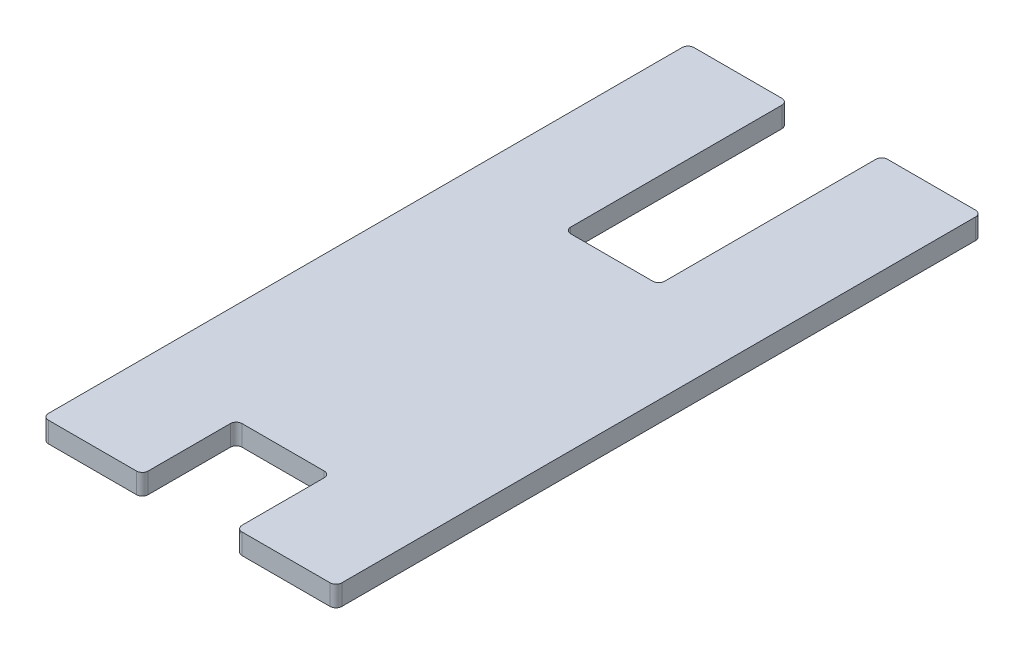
ISO-10303-21;
HEADER;
FILE_DESCRIPTION(('STEP AP214'),'2;1');
FILE_NAME('part.step','',(''),(''),'','','');
FILE_SCHEMA(('AUTOMOTIVE_DESIGN { 1 0 10303 214 1 1 1 1 }'));
ENDSEC;
DATA;
#1=APPLICATION_CONTEXT('core data for automotive mechanical design processes');
#2=APPLICATION_PROTOCOL_DEFINITION('international standard','automotive_design',2000,#1);
#3=PRODUCT_CONTEXT('',#1,'mechanical');
#4=PRODUCT('Part','Part','',(#3));
#5=PRODUCT_RELATED_PRODUCT_CATEGORY('part','',(#4));
#6=PRODUCT_DEFINITION_FORMATION('','',#4);
#7=PRODUCT_DEFINITION_CONTEXT('part definition',#1,'design');
#8=PRODUCT_DEFINITION('design','',#6,#7);
#9=PRODUCT_DEFINITION_SHAPE('','',#8);
#10=(LENGTH_UNIT() NAMED_UNIT(*) SI_UNIT(.MILLI.,.METRE.));
#11=(NAMED_UNIT(*) PLANE_ANGLE_UNIT() SI_UNIT($,.RADIAN.));
#12=(NAMED_UNIT(*) SI_UNIT($,.STERADIAN.) SOLID_ANGLE_UNIT());
#13=UNCERTAINTY_MEASURE_WITH_UNIT(LENGTH_MEASURE(1.E-05),#10,'distance_accuracy_value','');
#14=(GEOMETRIC_REPRESENTATION_CONTEXT(3) GLOBAL_UNCERTAINTY_ASSIGNED_CONTEXT((#13)) GLOBAL_UNIT_ASSIGNED_CONTEXT((#10,
#11,#12)) REPRESENTATION_CONTEXT('',''));
#15=CARTESIAN_POINT('',(0.,0.,0.));
#16=DIRECTION('',(0.,0.,1.));
#17=DIRECTION('',(1.,0.,0.));
#18=AXIS2_PLACEMENT_3D('',#15,#16,#17);
#19=CARTESIAN_POINT('',(-25.,3.5,-110.));
#20=DIRECTION('',(1.,0.,0.));
#21=DIRECTION('',(0.,0.,-1.));
#22=AXIS2_PLACEMENT_3D('',#19,#20,#21);
#23=PLANE('',#22);
#24=DIRECTION('',(0.,0.,1.));
#25=VECTOR('',#24,1.);
#26=CARTESIAN_POINT('',(-25.,3.5,-110.));
#27=LINE('',#26,#25);
#28=CARTESIAN_POINT('',(-25.,3.5,-109.));
#29=VERTEX_POINT('',#28);
#30=CARTESIAN_POINT('',(-25.,3.5,-1.));
#31=VERTEX_POINT('',#30);
#32=EDGE_CURVE('E213',#29,#31,#27,.T.);
#33=ORIENTED_EDGE('',*,*,#32,.F.);
#34=DIRECTION('',(0.,-1.,0.));
#35=VECTOR('',#34,1.);
#36=CARTESIAN_POINT('',(-25.,3.5,-109.));
#37=LINE('',#36,#35);
#38=CARTESIAN_POINT('',(-25.,0.,-109.));
#39=VERTEX_POINT('',#38);
#40=EDGE_CURVE('E198',#29,#39,#37,.T.);
#41=ORIENTED_EDGE('',*,*,#40,.T.);
#42=DIRECTION('',(0.,0.,1.));
#43=VECTOR('',#42,1.);
#44=CARTESIAN_POINT('',(-25.,0.,-110.));
#45=LINE('',#44,#43);
#46=CARTESIAN_POINT('',(-25.,0.,-1.));
#47=VERTEX_POINT('',#46);
#48=EDGE_CURVE('E210',#39,#47,#45,.T.);
#49=ORIENTED_EDGE('',*,*,#48,.T.);
#50=DIRECTION('',(0.,-1.,0.));
#51=VECTOR('',#50,1.);
#52=CARTESIAN_POINT('',(-25.,3.5,-1.));
#53=LINE('',#52,#51);
#54=EDGE_CURVE('E215',#47,#31,#53,.F.);
#55=ORIENTED_EDGE('',*,*,#54,.T.);
#56=EDGE_LOOP('',(#33,#41,#49,#55));
#57=FACE_BOUND('',#56,.T.);
#58=ADVANCED_FACE('F32',(#57),#23,.F.);
#59=CARTESIAN_POINT('',(-25.,3.5,0.));
#60=DIRECTION('',(0.,0.,-1.));
#61=DIRECTION('',(-1.,0.,0.));
#62=AXIS2_PLACEMENT_3D('',#59,#60,#61);
#63=PLANE('',#62);
#64=DIRECTION('',(1.,0.,0.));
#65=VECTOR('',#64,1.);
#66=CARTESIAN_POINT('',(-25.,0.,0.));
#67=LINE('',#66,#65);
#68=CARTESIAN_POINT('',(-24.,0.,0.));
#69=VERTEX_POINT('',#68);
#70=CARTESIAN_POINT('',(-9.,0.,0.));
#71=VERTEX_POINT('',#70);
#72=EDGE_CURVE('E220',#69,#71,#67,.T.);
#73=ORIENTED_EDGE('',*,*,#72,.T.);
#74=DIRECTION('',(0.,-1.,0.));
#75=VECTOR('',#74,1.);
#76=CARTESIAN_POINT('',(-9.,3.5,0.));
#77=LINE('',#76,#75);
#78=CARTESIAN_POINT('',(-9.,3.5,0.));
#79=VERTEX_POINT('',#78);
#80=EDGE_CURVE('E334',#71,#79,#77,.F.);
#81=ORIENTED_EDGE('',*,*,#80,.T.);
#82=DIRECTION('',(1.,0.,0.));
#83=VECTOR('',#82,1.);
#84=CARTESIAN_POINT('',(-25.,3.5,0.));
#85=LINE('',#84,#83);
#86=CARTESIAN_POINT('',(-24.,3.5,0.));
#87=VERTEX_POINT('',#86);
#88=EDGE_CURVE('E373',#87,#79,#85,.T.);
#89=ORIENTED_EDGE('',*,*,#88,.F.);
#90=DIRECTION('',(0.,-1.,0.));
#91=VECTOR('',#90,1.);
#92=CARTESIAN_POINT('',(-24.,3.5,0.));
#93=LINE('',#92,#91);
#94=EDGE_CURVE('E331',#87,#69,#93,.T.);
#95=ORIENTED_EDGE('',*,*,#94,.T.);
#96=EDGE_LOOP('',(#73,#81,#89,#95));
#97=FACE_BOUND('',#96,.T.);
#98=ADVANCED_FACE('F464',(#97),#63,.F.);
#99=CARTESIAN_POINT('',(-8.,3.5,-16.));
#100=DIRECTION('',(-1.,0.,0.));
#101=DIRECTION('',(0.,0.,1.));
#102=AXIS2_PLACEMENT_3D('',#99,#100,#101);
#103=PLANE('',#102);
#104=DIRECTION('',(0.,0.,-1.));
#105=VECTOR('',#104,1.);
#106=CARTESIAN_POINT('',(-8.,0.,-16.));
#107=LINE('',#106,#105);
#108=CARTESIAN_POINT('',(-8.,0.,-1.));
#109=VERTEX_POINT('',#108);
#110=CARTESIAN_POINT('',(-8.,0.,-15.));
#111=VERTEX_POINT('',#110);
#112=EDGE_CURVE('E223',#109,#111,#107,.T.);
#113=ORIENTED_EDGE('',*,*,#112,.T.);
#114=DIRECTION('',(0.,-1.,0.));
#115=VECTOR('',#114,1.);
#116=CARTESIAN_POINT('',(-8.,3.5,-15.));
#117=LINE('',#116,#115);
#118=CARTESIAN_POINT('',(-8.,3.5,-15.));
#119=VERTEX_POINT('',#118);
#120=EDGE_CURVE('E329',#111,#119,#117,.F.);
#121=ORIENTED_EDGE('',*,*,#120,.T.);
#122=DIRECTION('',(0.,0.,-1.));
#123=VECTOR('',#122,1.);
#124=CARTESIAN_POINT('',(-8.,3.5,-16.));
#125=LINE('',#124,#123);
#126=CARTESIAN_POINT('',(-8.,3.5,-1.));
#127=VERTEX_POINT('',#126);
#128=EDGE_CURVE('E364',#127,#119,#125,.T.);
#129=ORIENTED_EDGE('',*,*,#128,.F.);
#130=DIRECTION('',(0.,-1.,0.));
#131=VECTOR('',#130,1.);
#132=CARTESIAN_POINT('',(-8.,3.5,-1.));
#133=LINE('',#132,#131);
#134=EDGE_CURVE('E326',#127,#109,#133,.T.);
#135=ORIENTED_EDGE('',*,*,#134,.T.);
#136=EDGE_LOOP('',(#113,#121,#129,#135));
#137=FACE_BOUND('',#136,.T.);
#138=ADVANCED_FACE('F352',(#137),#103,.F.);
#139=CARTESIAN_POINT('',(-8.,3.5,-16.));
#140=DIRECTION('',(0.,0.,-1.));
#141=DIRECTION('',(-1.,0.,0.));
#142=AXIS2_PLACEMENT_3D('',#139,#140,#141);
#143=PLANE('',#142);
#144=DIRECTION('',(1.,0.,0.));
#145=VECTOR('',#144,1.);
#146=CARTESIAN_POINT('',(-8.,0.,-16.));
#147=LINE('',#146,#145);
#148=CARTESIAN_POINT('',(-7.,0.,-16.));
#149=VERTEX_POINT('',#148);
#150=CARTESIAN_POINT('',(7.,0.,-16.));
#151=VERTEX_POINT('',#150);
#152=EDGE_CURVE('E231',#149,#151,#147,.T.);
#153=ORIENTED_EDGE('',*,*,#152,.T.);
#154=DIRECTION('',(0.,-1.,0.));
#155=VECTOR('',#154,1.);
#156=CARTESIAN_POINT('',(7.,3.5,-16.));
#157=LINE('',#156,#155);
#158=CARTESIAN_POINT('',(7.,3.5,-16.));
#159=VERTEX_POINT('',#158);
#160=EDGE_CURVE('E324',#151,#159,#157,.F.);
#161=ORIENTED_EDGE('',*,*,#160,.T.);
#162=DIRECTION('',(1.,0.,0.));
#163=VECTOR('',#162,1.);
#164=CARTESIAN_POINT('',(-8.,3.5,-16.));
#165=LINE('',#164,#163);
#166=CARTESIAN_POINT('',(-7.,3.5,-16.));
#167=VERTEX_POINT('',#166);
#168=EDGE_CURVE('E362',#167,#159,#165,.T.);
#169=ORIENTED_EDGE('',*,*,#168,.F.);
#170=DIRECTION('',(0.,-1.,0.));
#171=VECTOR('',#170,1.);
#172=CARTESIAN_POINT('',(-7.,0.,-16.));
#173=LINE('',#172,#171);
#174=EDGE_CURVE('E321',#167,#149,#173,.T.);
#175=ORIENTED_EDGE('',*,*,#174,.T.);
#176=EDGE_LOOP('',(#153,#161,#169,#175));
#177=FACE_BOUND('',#176,.T.);
#178=ADVANCED_FACE('F366',(#177),#143,.F.);
#179=CARTESIAN_POINT('',(8.,3.5,-16.));
#180=DIRECTION('',(1.,0.,0.));
#181=DIRECTION('',(0.,0.,-1.));
#182=AXIS2_PLACEMENT_3D('',#179,#180,#181);
#183=PLANE('',#182);
#184=DIRECTION('',(0.,0.,1.));
#185=VECTOR('',#184,1.);
#186=CARTESIAN_POINT('',(8.,0.,-16.));
#187=LINE('',#186,#185);
#188=CARTESIAN_POINT('',(8.,0.,-15.));
#189=VERTEX_POINT('',#188);
#190=CARTESIAN_POINT('',(8.,0.,-1.));
#191=VERTEX_POINT('',#190);
#192=EDGE_CURVE('E234',#189,#191,#187,.T.);
#193=ORIENTED_EDGE('',*,*,#192,.T.);
#194=DIRECTION('',(0.,-1.,0.));
#195=VECTOR('',#194,1.);
#196=CARTESIAN_POINT('',(8.,3.5,-1.));
#197=LINE('',#196,#195);
#198=CARTESIAN_POINT('',(8.,3.5,-1.));
#199=VERTEX_POINT('',#198);
#200=EDGE_CURVE('E319',#191,#199,#197,.F.);
#201=ORIENTED_EDGE('',*,*,#200,.T.);
#202=DIRECTION('',(0.,0.,1.));
#203=VECTOR('',#202,1.);
#204=CARTESIAN_POINT('',(8.,3.5,-16.));
#205=LINE('',#204,#203);
#206=CARTESIAN_POINT('',(8.,3.5,-15.));
#207=VERTEX_POINT('',#206);
#208=EDGE_CURVE('E368',#207,#199,#205,.T.);
#209=ORIENTED_EDGE('',*,*,#208,.F.);
#210=DIRECTION('',(0.,-1.,0.));
#211=VECTOR('',#210,1.);
#212=CARTESIAN_POINT('',(8.,0.,-15.));
#213=LINE('',#212,#211);
#214=EDGE_CURVE('E316',#207,#189,#213,.T.);
#215=ORIENTED_EDGE('',*,*,#214,.T.);
#216=EDGE_LOOP('',(#193,#201,#209,#215));
#217=FACE_BOUND('',#216,.T.);
#218=ADVANCED_FACE('F449',(#217),#183,.F.);
#219=CARTESIAN_POINT('',(8.,3.5,0.));
#220=DIRECTION('',(0.,0.,-1.));
#221=DIRECTION('',(-1.,0.,0.));
#222=AXIS2_PLACEMENT_3D('',#219,#220,#221);
#223=PLANE('',#222);
#224=DIRECTION('',(1.,0.,0.));
#225=VECTOR('',#224,1.);
#226=CARTESIAN_POINT('',(8.,3.5,0.));
#227=LINE('',#226,#225);
#228=CARTESIAN_POINT('',(9.,3.5,0.));
#229=VERTEX_POINT('',#228);
#230=CARTESIAN_POINT('',(24.,3.5,0.));
#231=VERTEX_POINT('',#230);
#232=EDGE_CURVE('E371',#229,#231,#227,.T.);
#233=ORIENTED_EDGE('',*,*,#232,.F.);
#234=DIRECTION('',(0.,-1.,0.));
#235=VECTOR('',#234,1.);
#236=CARTESIAN_POINT('',(9.,3.5,0.));
#237=LINE('',#236,#235);
#238=CARTESIAN_POINT('',(9.,0.,0.));
#239=VERTEX_POINT('',#238);
#240=EDGE_CURVE('E313',#229,#239,#237,.T.);
#241=ORIENTED_EDGE('',*,*,#240,.T.);
#242=DIRECTION('',(1.,0.,0.));
#243=VECTOR('',#242,1.);
#244=CARTESIAN_POINT('',(8.,0.,0.));
#245=LINE('',#244,#243);
#246=CARTESIAN_POINT('',(24.,0.,0.));
#247=VERTEX_POINT('',#246);
#248=EDGE_CURVE('E237',#239,#247,#245,.T.);
#249=ORIENTED_EDGE('',*,*,#248,.T.);
#250=DIRECTION('',(0.,-1.,0.));
#251=VECTOR('',#250,1.);
#252=CARTESIAN_POINT('',(24.,3.5,0.));
#253=LINE('',#252,#251);
#254=EDGE_CURVE('E311',#247,#231,#253,.F.);
#255=ORIENTED_EDGE('',*,*,#254,.T.);
#256=EDGE_LOOP('',(#233,#241,#249,#255));
#257=FACE_BOUND('',#256,.T.);
#258=ADVANCED_FACE('F441',(#257),#223,.F.);
#259=CARTESIAN_POINT('',(25.,3.5,-110.));
#260=DIRECTION('',(-1.,0.,0.));
#261=DIRECTION('',(0.,0.,1.));
#262=AXIS2_PLACEMENT_3D('',#259,#260,#261);
#263=PLANE('',#262);
#264=DIRECTION('',(0.,0.,-1.));
#265=VECTOR('',#264,1.);
#266=CARTESIAN_POINT('',(25.,0.,-110.));
#267=LINE('',#266,#265);
#268=CARTESIAN_POINT('',(25.,0.,-1.));
#269=VERTEX_POINT('',#268);
#270=CARTESIAN_POINT('',(25.,0.,-109.));
#271=VERTEX_POINT('',#270);
#272=EDGE_CURVE('E240',#269,#271,#267,.T.);
#273=ORIENTED_EDGE('',*,*,#272,.T.);
#274=DIRECTION('',(0.,-1.,0.));
#275=VECTOR('',#274,1.);
#276=CARTESIAN_POINT('',(25.,3.5,-109.));
#277=LINE('',#276,#275);
#278=CARTESIAN_POINT('',(25.,3.5,-109.));
#279=VERTEX_POINT('',#278);
#280=EDGE_CURVE('E309',#271,#279,#277,.F.);
#281=ORIENTED_EDGE('',*,*,#280,.T.);
#282=DIRECTION('',(0.,0.,-1.));
#283=VECTOR('',#282,1.);
#284=CARTESIAN_POINT('',(25.,3.5,-110.));
#285=LINE('',#284,#283);
#286=CARTESIAN_POINT('',(25.,3.5,-1.));
#287=VERTEX_POINT('',#286);
#288=EDGE_CURVE('E379',#287,#279,#285,.T.);
#289=ORIENTED_EDGE('',*,*,#288,.F.);
#290=DIRECTION('',(0.,-1.,0.));
#291=VECTOR('',#290,1.);
#292=CARTESIAN_POINT('',(25.,3.5,-1.));
#293=LINE('',#292,#291);
#294=EDGE_CURVE('E306',#287,#269,#293,.T.);
#295=ORIENTED_EDGE('',*,*,#294,.T.);
#296=EDGE_LOOP('',(#273,#281,#289,#295));
#297=FACE_BOUND('',#296,.T.);
#298=ADVANCED_FACE('F432',(#297),#263,.F.);
#299=CARTESIAN_POINT('',(7.99999999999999,3.5,-110.));
#300=DIRECTION('',(0.,0.,1.));
#301=DIRECTION('',(1.,0.,0.));
#302=AXIS2_PLACEMENT_3D('',#299,#300,#301);
#303=PLANE('',#302);
#304=DIRECTION('',(-1.,0.,0.));
#305=VECTOR('',#304,1.);
#306=CARTESIAN_POINT('',(7.99999999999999,0.,-110.));
#307=LINE('',#306,#305);
#308=CARTESIAN_POINT('',(24.,0.,-110.));
#309=VERTEX_POINT('',#308);
#310=CARTESIAN_POINT('',(8.99999999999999,0.,-110.));
#311=VERTEX_POINT('',#310);
#312=EDGE_CURVE('E243',#309,#311,#307,.T.);
#313=ORIENTED_EDGE('',*,*,#312,.T.);
#314=DIRECTION('',(0.,-1.,0.));
#315=VECTOR('',#314,1.);
#316=CARTESIAN_POINT('',(8.99999999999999,3.5,-110.));
#317=LINE('',#316,#315);
#318=CARTESIAN_POINT('',(8.99999999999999,3.5,-110.));
#319=VERTEX_POINT('',#318);
#320=EDGE_CURVE('E304',#311,#319,#317,.F.);
#321=ORIENTED_EDGE('',*,*,#320,.T.);
#322=DIRECTION('',(-1.,0.,0.));
#323=VECTOR('',#322,1.);
#324=CARTESIAN_POINT('',(7.99999999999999,3.5,-110.));
#325=LINE('',#324,#323);
#326=CARTESIAN_POINT('',(24.,3.5,-110.));
#327=VERTEX_POINT('',#326);
#328=EDGE_CURVE('E382',#327,#319,#325,.T.);
#329=ORIENTED_EDGE('',*,*,#328,.F.);
#330=DIRECTION('',(0.,-1.,0.));
#331=VECTOR('',#330,1.);
#332=CARTESIAN_POINT('',(24.,3.5,-110.));
#333=LINE('',#332,#331);
#334=EDGE_CURVE('E301',#327,#309,#333,.T.);
#335=ORIENTED_EDGE('',*,*,#334,.T.);
#336=EDGE_LOOP('',(#313,#321,#329,#335));
#337=FACE_BOUND('',#336,.T.);
#338=ADVANCED_FACE('F423',(#337),#303,.F.);
#339=CARTESIAN_POINT('',(7.99999999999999,3.5,-110.));
#340=DIRECTION('',(1.,0.,0.));
#341=DIRECTION('',(0.,0.,-1.));
#342=AXIS2_PLACEMENT_3D('',#339,#340,#341);
#343=PLANE('',#342);
#344=DIRECTION('',(0.,0.,1.));
#345=VECTOR('',#344,1.);
#346=CARTESIAN_POINT('',(7.99999999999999,0.,-110.));
#347=LINE('',#346,#345);
#348=CARTESIAN_POINT('',(7.99999999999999,0.,-109.));
#349=VERTEX_POINT('',#348);
#350=CARTESIAN_POINT('',(7.99999999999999,0.,-73.));
#351=VERTEX_POINT('',#350);
#352=EDGE_CURVE('E246',#349,#351,#347,.T.);
#353=ORIENTED_EDGE('',*,*,#352,.T.);
#354=DIRECTION('',(0.,-1.,0.));
#355=VECTOR('',#354,1.);
#356=CARTESIAN_POINT('',(7.99999999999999,3.5,-73.));
#357=LINE('',#356,#355);
#358=CARTESIAN_POINT('',(7.99999999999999,3.5,-73.));
#359=VERTEX_POINT('',#358);
#360=EDGE_CURVE('E299',#351,#359,#357,.F.);
#361=ORIENTED_EDGE('',*,*,#360,.T.);
#362=DIRECTION('',(0.,0.,1.));
#363=VECTOR('',#362,1.);
#364=CARTESIAN_POINT('',(7.99999999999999,3.5,-110.));
#365=LINE('',#364,#363);
#366=CARTESIAN_POINT('',(7.99999999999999,3.5,-109.));
#367=VERTEX_POINT('',#366);
#368=EDGE_CURVE('E385',#367,#359,#365,.T.);
#369=ORIENTED_EDGE('',*,*,#368,.F.);
#370=DIRECTION('',(0.,-1.,0.));
#371=VECTOR('',#370,1.);
#372=CARTESIAN_POINT('',(7.99999999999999,3.5,-109.));
#373=LINE('',#372,#371);
#374=EDGE_CURVE('E296',#367,#349,#373,.T.);
#375=ORIENTED_EDGE('',*,*,#374,.T.);
#376=EDGE_LOOP('',(#353,#361,#369,#375));
#377=FACE_BOUND('',#376,.T.);
#378=ADVANCED_FACE('F414',(#377),#343,.F.);
#379=CARTESIAN_POINT('',(-7.99999999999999,3.5,-72.));
#380=DIRECTION('',(0.,0.,1.));
#381=DIRECTION('',(1.,0.,0.));
#382=AXIS2_PLACEMENT_3D('',#379,#380,#381);
#383=PLANE('',#382);
#384=DIRECTION('',(-1.,0.,0.));
#385=VECTOR('',#384,1.);
#386=CARTESIAN_POINT('',(-7.99999999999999,0.,-72.));
#387=LINE('',#386,#385);
#388=CARTESIAN_POINT('',(6.99999999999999,0.,-72.));
#389=VERTEX_POINT('',#388);
#390=CARTESIAN_POINT('',(-6.99999999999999,0.,-72.));
#391=VERTEX_POINT('',#390);
#392=EDGE_CURVE('E249',#389,#391,#387,.T.);
#393=ORIENTED_EDGE('',*,*,#392,.T.);
#394=DIRECTION('',(0.,-1.,0.));
#395=VECTOR('',#394,1.);
#396=CARTESIAN_POINT('',(-6.99999999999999,3.5,-72.));
#397=LINE('',#396,#395);
#398=CARTESIAN_POINT('',(-6.99999999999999,3.5,-72.));
#399=VERTEX_POINT('',#398);
#400=EDGE_CURVE('E294',#391,#399,#397,.F.);
#401=ORIENTED_EDGE('',*,*,#400,.T.);
#402=DIRECTION('',(-1.,0.,0.));
#403=VECTOR('',#402,1.);
#404=CARTESIAN_POINT('',(-7.99999999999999,3.5,-72.));
#405=LINE('',#404,#403);
#406=CARTESIAN_POINT('',(6.99999999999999,3.5,-72.));
#407=VERTEX_POINT('',#406);
#408=EDGE_CURVE('E388',#407,#399,#405,.T.);
#409=ORIENTED_EDGE('',*,*,#408,.F.);
#410=DIRECTION('',(0.,-1.,0.));
#411=VECTOR('',#410,1.);
#412=CARTESIAN_POINT('',(6.99999999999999,0.,-72.));
#413=LINE('',#412,#411);
#414=EDGE_CURVE('E291',#407,#389,#413,.T.);
#415=ORIENTED_EDGE('',*,*,#414,.T.);
#416=EDGE_LOOP('',(#393,#401,#409,#415));
#417=FACE_BOUND('',#416,.T.);
#418=ADVANCED_FACE('F405',(#417),#383,.F.);
#419=CARTESIAN_POINT('',(-7.99999999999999,3.5,-110.));
#420=DIRECTION('',(-1.,0.,0.));
#421=DIRECTION('',(0.,0.,1.));
#422=AXIS2_PLACEMENT_3D('',#419,#420,#421);
#423=PLANE('',#422);
#424=DIRECTION('',(0.,0.,-1.));
#425=VECTOR('',#424,1.);
#426=CARTESIAN_POINT('',(-7.99999999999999,0.,-110.));
#427=LINE('',#426,#425);
#428=CARTESIAN_POINT('',(-7.99999999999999,0.,-73.));
#429=VERTEX_POINT('',#428);
#430=CARTESIAN_POINT('',(-7.99999999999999,0.,-109.));
#431=VERTEX_POINT('',#430);
#432=EDGE_CURVE('E252',#429,#431,#427,.T.);
#433=ORIENTED_EDGE('',*,*,#432,.T.);
#434=DIRECTION('',(0.,-1.,0.));
#435=VECTOR('',#434,1.);
#436=CARTESIAN_POINT('',(-7.99999999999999,3.5,-109.));
#437=LINE('',#436,#435);
#438=CARTESIAN_POINT('',(-7.99999999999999,3.5,-109.));
#439=VERTEX_POINT('',#438);
#440=EDGE_CURVE('E47',#431,#439,#437,.F.);
#441=ORIENTED_EDGE('',*,*,#440,.T.);
#442=DIRECTION('',(0.,0.,-1.));
#443=VECTOR('',#442,1.);
#444=CARTESIAN_POINT('',(-7.99999999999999,3.5,-110.));
#445=LINE('',#444,#443);
#446=CARTESIAN_POINT('',(-7.99999999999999,3.5,-73.));
#447=VERTEX_POINT('',#446);
#448=EDGE_CURVE('E389',#447,#439,#445,.T.);
#449=ORIENTED_EDGE('',*,*,#448,.F.);
#450=DIRECTION('',(0.,-1.,0.));
#451=VECTOR('',#450,1.);
#452=CARTESIAN_POINT('',(-7.99999999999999,0.,-73.));
#453=LINE('',#452,#451);
#454=EDGE_CURVE('E287',#447,#429,#453,.T.);
#455=ORIENTED_EDGE('',*,*,#454,.T.);
#456=EDGE_LOOP('',(#433,#441,#449,#455));
#457=FACE_BOUND('',#456,.T.);
#458=ADVANCED_FACE('F398',(#457),#423,.F.);
#459=CARTESIAN_POINT('',(-25.,3.5,-110.));
#460=DIRECTION('',(0.,0.,1.));
#461=DIRECTION('',(1.,0.,0.));
#462=AXIS2_PLACEMENT_3D('',#459,#460,#461);
#463=PLANE('',#462);
#464=DIRECTION('',(-1.,0.,0.));
#465=VECTOR('',#464,1.);
#466=CARTESIAN_POINT('',(-25.,0.,-110.));
#467=LINE('',#466,#465);
#468=CARTESIAN_POINT('',(-8.99999999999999,0.,-110.));
#469=VERTEX_POINT('',#468);
#470=CARTESIAN_POINT('',(-24.,0.,-110.));
#471=VERTEX_POINT('',#470);
#472=EDGE_CURVE('E254',#469,#471,#467,.T.);
#473=ORIENTED_EDGE('',*,*,#472,.T.);
#474=DIRECTION('',(0.,-1.,0.));
#475=VECTOR('',#474,1.);
#476=CARTESIAN_POINT('',(-24.,3.5,-110.));
#477=LINE('',#476,#475);
#478=CARTESIAN_POINT('',(-24.,3.5,-110.));
#479=VERTEX_POINT('',#478);
#480=EDGE_CURVE('E199',#471,#479,#477,.F.);
#481=ORIENTED_EDGE('',*,*,#480,.T.);
#482=DIRECTION('',(-1.,0.,0.));
#483=VECTOR('',#482,1.);
#484=CARTESIAN_POINT('',(-25.,3.5,-110.));
#485=LINE('',#484,#483);
#486=CARTESIAN_POINT('',(-8.99999999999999,3.5,-110.));
#487=VERTEX_POINT('',#486);
#488=EDGE_CURVE('E226',#487,#479,#485,.T.);
#489=ORIENTED_EDGE('',*,*,#488,.F.);
#490=DIRECTION('',(0.,-1.,0.));
#491=VECTOR('',#490,1.);
#492=CARTESIAN_POINT('',(-8.99999999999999,3.5,-110.));
#493=LINE('',#492,#491);
#494=EDGE_CURVE('E204',#487,#469,#493,.T.);
#495=ORIENTED_EDGE('',*,*,#494,.T.);
#496=EDGE_LOOP('',(#473,#481,#489,#495));
#497=FACE_BOUND('',#496,.T.);
#498=ADVANCED_FACE('F394',(#497),#463,.F.);
#499=CARTESIAN_POINT('',(0.,3.5,0.));
#500=DIRECTION('',(0.,1.,0.));
#501=DIRECTION('',(0.,0.,1.));
#502=AXIS2_PLACEMENT_3D('',#499,#500,#501);
#503=PLANE('',#502);
#504=ORIENTED_EDGE('',*,*,#488,.T.);
#505=CARTESIAN_POINT('',(-24.,3.5,-109.));
#506=DIRECTION('',(0.,1.,0.));
#507=DIRECTION('',(0.,0.,1.));
#508=AXIS2_PLACEMENT_3D('',#505,#506,#507);
#509=CIRCLE('',#508,1.);
#510=EDGE_CURVE('E285',#479,#29,#509,.T.);
#511=ORIENTED_EDGE('',*,*,#510,.T.);
#512=ORIENTED_EDGE('',*,*,#32,.T.);
#513=CARTESIAN_POINT('',(-24.,3.5,-1.));
#514=DIRECTION('',(0.,1.,0.));
#515=DIRECTION('',(0.,0.,1.));
#516=AXIS2_PLACEMENT_3D('',#513,#514,#515);
#517=CIRCLE('',#516,1.);
#518=EDGE_CURVE('E273',#31,#87,#517,.T.);
#519=ORIENTED_EDGE('',*,*,#518,.T.);
#520=ORIENTED_EDGE('',*,*,#88,.T.);
#521=CARTESIAN_POINT('',(-9.,3.5,-1.));
#522=DIRECTION('',(0.,1.,0.));
#523=DIRECTION('',(0.,0.,1.));
#524=AXIS2_PLACEMENT_3D('',#521,#522,#523);
#525=CIRCLE('',#524,1.);
#526=EDGE_CURVE('E275',#79,#127,#525,.T.);
#527=ORIENTED_EDGE('',*,*,#526,.T.);
#528=ORIENTED_EDGE('',*,*,#128,.T.);
#529=CARTESIAN_POINT('',(-7.,3.5,-15.));
#530=DIRECTION('',(0.,1.,0.));
#531=DIRECTION('',(0.,0.,1.));
#532=AXIS2_PLACEMENT_3D('',#529,#530,#531);
#533=CIRCLE('',#532,1.);
#534=EDGE_CURVE('E11',#119,#167,#533,.F.);
#535=ORIENTED_EDGE('',*,*,#534,.T.);
#536=ORIENTED_EDGE('',*,*,#168,.T.);
#537=CARTESIAN_POINT('',(7.,3.5,-15.));
#538=DIRECTION('',(0.,1.,0.));
#539=DIRECTION('',(0.,0.,1.));
#540=AXIS2_PLACEMENT_3D('',#537,#538,#539);
#541=CIRCLE('',#540,1.);
#542=EDGE_CURVE('E345',#159,#207,#541,.F.);
#543=ORIENTED_EDGE('',*,*,#542,.T.);
#544=ORIENTED_EDGE('',*,*,#208,.T.);
#545=CARTESIAN_POINT('',(9.,3.5,-1.));
#546=DIRECTION('',(0.,1.,0.));
#547=DIRECTION('',(0.,0.,1.));
#548=AXIS2_PLACEMENT_3D('',#545,#546,#547);
#549=CIRCLE('',#548,1.);
#550=EDGE_CURVE('E277',#199,#229,#549,.T.);
#551=ORIENTED_EDGE('',*,*,#550,.T.);
#552=ORIENTED_EDGE('',*,*,#232,.T.);
#553=CARTESIAN_POINT('',(24.,3.5,-1.));
#554=DIRECTION('',(0.,1.,0.));
#555=DIRECTION('',(0.,0.,1.));
#556=AXIS2_PLACEMENT_3D('',#553,#554,#555);
#557=CIRCLE('',#556,1.);
#558=EDGE_CURVE('E271',#231,#287,#557,.T.);
#559=ORIENTED_EDGE('',*,*,#558,.T.);
#560=ORIENTED_EDGE('',*,*,#288,.T.);
#561=CARTESIAN_POINT('',(24.,3.5,-109.));
#562=DIRECTION('',(0.,1.,0.));
#563=DIRECTION('',(0.,0.,1.));
#564=AXIS2_PLACEMENT_3D('',#561,#562,#563);
#565=CIRCLE('',#564,1.);
#566=EDGE_CURVE('E279',#279,#327,#565,.T.);
#567=ORIENTED_EDGE('',*,*,#566,.T.);
#568=ORIENTED_EDGE('',*,*,#328,.T.);
#569=CARTESIAN_POINT('',(8.99999999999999,3.5,-109.));
#570=DIRECTION('',(0.,1.,0.));
#571=DIRECTION('',(0.,0.,1.));
#572=AXIS2_PLACEMENT_3D('',#569,#570,#571);
#573=CIRCLE('',#572,1.);
#574=EDGE_CURVE('E281',#319,#367,#573,.T.);
#575=ORIENTED_EDGE('',*,*,#574,.T.);
#576=ORIENTED_EDGE('',*,*,#368,.T.);
#577=CARTESIAN_POINT('',(6.99999999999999,3.5,-73.));
#578=DIRECTION('',(0.,1.,0.));
#579=DIRECTION('',(0.,0.,1.));
#580=AXIS2_PLACEMENT_3D('',#577,#578,#579);
#581=CIRCLE('',#580,1.);
#582=EDGE_CURVE('E341',#359,#407,#581,.F.);
#583=ORIENTED_EDGE('',*,*,#582,.T.);
#584=ORIENTED_EDGE('',*,*,#408,.T.);
#585=CARTESIAN_POINT('',(-6.99999999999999,3.5,-73.));
#586=DIRECTION('',(0.,1.,0.));
#587=DIRECTION('',(0.,0.,1.));
#588=AXIS2_PLACEMENT_3D('',#585,#586,#587);
#589=CIRCLE('',#588,1.);
#590=EDGE_CURVE('E54',#399,#447,#589,.F.);
#591=ORIENTED_EDGE('',*,*,#590,.T.);
#592=ORIENTED_EDGE('',*,*,#448,.T.);
#593=CARTESIAN_POINT('',(-8.99999999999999,3.5,-109.));
#594=DIRECTION('',(0.,1.,0.));
#595=DIRECTION('',(0.,0.,1.));
#596=AXIS2_PLACEMENT_3D('',#593,#594,#595);
#597=CIRCLE('',#596,1.);
#598=EDGE_CURVE('E283',#439,#487,#597,.T.);
#599=ORIENTED_EDGE('',*,*,#598,.T.);
#600=EDGE_LOOP('',(#504,#511,#512,#519,#520,#527,#528,#535,#536,#543,#544,#551,#552,#559,#560,
#567,#568,#575,#576,#583,#584,#591,#592,#599));
#601=FACE_BOUND('',#600,.T.);
#602=ADVANCED_FACE('F361',(#601),#503,.T.);
#603=CARTESIAN_POINT('',(0.,0.,0.));
#604=DIRECTION('',(0.,1.,0.));
#605=DIRECTION('',(0.,0.,1.));
#606=AXIS2_PLACEMENT_3D('',#603,#604,#605);
#607=PLANE('',#606);
#608=ORIENTED_EDGE('',*,*,#48,.F.);
#609=CARTESIAN_POINT('',(-24.,0.,-109.));
#610=DIRECTION('',(0.,1.,0.));
#611=DIRECTION('',(0.,0.,1.));
#612=AXIS2_PLACEMENT_3D('',#609,#610,#611);
#613=CIRCLE('',#612,1.);
#614=EDGE_CURVE('E194',#39,#471,#613,.F.);
#615=ORIENTED_EDGE('',*,*,#614,.T.);
#616=ORIENTED_EDGE('',*,*,#472,.F.);
#617=CARTESIAN_POINT('',(-8.99999999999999,0.,-109.));
#618=DIRECTION('',(0.,1.,0.));
#619=DIRECTION('',(0.,0.,1.));
#620=AXIS2_PLACEMENT_3D('',#617,#618,#619);
#621=CIRCLE('',#620,1.);
#622=EDGE_CURVE('E205',#469,#431,#621,.F.);
#623=ORIENTED_EDGE('',*,*,#622,.T.);
#624=ORIENTED_EDGE('',*,*,#432,.F.);
#625=CARTESIAN_POINT('',(-6.99999999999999,0.,-73.));
#626=DIRECTION('',(0.,1.,0.));
#627=DIRECTION('',(0.,0.,1.));
#628=AXIS2_PLACEMENT_3D('',#625,#626,#627);
#629=CIRCLE('',#628,1.);
#630=EDGE_CURVE('E336',#429,#391,#629,.T.);
#631=ORIENTED_EDGE('',*,*,#630,.T.);
#632=ORIENTED_EDGE('',*,*,#392,.F.);
#633=CARTESIAN_POINT('',(6.99999999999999,0.,-73.));
#634=DIRECTION('',(0.,1.,0.));
#635=DIRECTION('',(0.,0.,1.));
#636=AXIS2_PLACEMENT_3D('',#633,#634,#635);
#637=CIRCLE('',#636,1.);
#638=EDGE_CURVE('E339',#389,#351,#637,.T.);
#639=ORIENTED_EDGE('',*,*,#638,.T.);
#640=ORIENTED_EDGE('',*,*,#352,.F.);
#641=CARTESIAN_POINT('',(8.99999999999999,0.,-109.));
#642=DIRECTION('',(0.,1.,0.));
#643=DIRECTION('',(0.,0.,1.));
#644=AXIS2_PLACEMENT_3D('',#641,#642,#643);
#645=CIRCLE('',#644,1.);
#646=EDGE_CURVE('E265',#349,#311,#645,.F.);
#647=ORIENTED_EDGE('',*,*,#646,.T.);
#648=ORIENTED_EDGE('',*,*,#312,.F.);
#649=CARTESIAN_POINT('',(24.,0.,-109.));
#650=DIRECTION('',(0.,1.,0.));
#651=DIRECTION('',(0.,0.,1.));
#652=AXIS2_PLACEMENT_3D('',#649,#650,#651);
#653=CIRCLE('',#652,1.);
#654=EDGE_CURVE('E263',#309,#271,#653,.F.);
#655=ORIENTED_EDGE('',*,*,#654,.T.);
#656=ORIENTED_EDGE('',*,*,#272,.F.);
#657=CARTESIAN_POINT('',(24.,0.,-1.));
#658=DIRECTION('',(0.,1.,0.));
#659=DIRECTION('',(0.,0.,1.));
#660=AXIS2_PLACEMENT_3D('',#657,#658,#659);
#661=CIRCLE('',#660,1.);
#662=EDGE_CURVE('E214',#269,#247,#661,.F.);
#663=ORIENTED_EDGE('',*,*,#662,.T.);
#664=ORIENTED_EDGE('',*,*,#248,.F.);
#665=CARTESIAN_POINT('',(9.,0.,-1.));
#666=DIRECTION('',(0.,1.,0.));
#667=DIRECTION('',(0.,0.,1.));
#668=AXIS2_PLACEMENT_3D('',#665,#666,#667);
#669=CIRCLE('',#668,1.);
#670=EDGE_CURVE('E261',#239,#191,#669,.F.);
#671=ORIENTED_EDGE('',*,*,#670,.T.);
#672=ORIENTED_EDGE('',*,*,#192,.F.);
#673=CARTESIAN_POINT('',(7.,0.,-15.));
#674=DIRECTION('',(0.,1.,0.));
#675=DIRECTION('',(0.,0.,1.));
#676=AXIS2_PLACEMENT_3D('',#673,#674,#675);
#677=CIRCLE('',#676,1.);
#678=EDGE_CURVE('E343',#189,#151,#677,.T.);
#679=ORIENTED_EDGE('',*,*,#678,.T.);
#680=ORIENTED_EDGE('',*,*,#152,.F.);
#681=CARTESIAN_POINT('',(-7.,0.,-15.));
#682=DIRECTION('',(0.,1.,0.));
#683=DIRECTION('',(0.,0.,1.));
#684=AXIS2_PLACEMENT_3D('',#681,#682,#683);
#685=CIRCLE('',#684,1.);
#686=EDGE_CURVE('E40',#149,#111,#685,.T.);
#687=ORIENTED_EDGE('',*,*,#686,.T.);
#688=ORIENTED_EDGE('',*,*,#112,.F.);
#689=CARTESIAN_POINT('',(-9.,0.,-1.));
#690=DIRECTION('',(0.,1.,0.));
#691=DIRECTION('',(0.,0.,1.));
#692=AXIS2_PLACEMENT_3D('',#689,#690,#691);
#693=CIRCLE('',#692,1.);
#694=EDGE_CURVE('E259',#109,#71,#693,.F.);
#695=ORIENTED_EDGE('',*,*,#694,.T.);
#696=ORIENTED_EDGE('',*,*,#72,.F.);
#697=CARTESIAN_POINT('',(-24.,0.,-1.));
#698=DIRECTION('',(0.,1.,0.));
#699=DIRECTION('',(0.,0.,1.));
#700=AXIS2_PLACEMENT_3D('',#697,#698,#699);
#701=CIRCLE('',#700,1.);
#702=EDGE_CURVE('E219',#69,#47,#701,.F.);
#703=ORIENTED_EDGE('',*,*,#702,.T.);
#704=EDGE_LOOP('',(#608,#615,#616,#623,#624,#631,#632,#639,#640,#647,#648,#655,#656,#663,#664,
#671,#672,#679,#680,#687,#688,#695,#696,#703));
#705=FACE_BOUND('',#704,.T.);
#706=ADVANCED_FACE('F217',(#705),#607,.F.);
#707=CARTESIAN_POINT('',(-24.,3.5,-109.));
#708=DIRECTION('',(0.,-1.,0.));
#709=DIRECTION('',(0.,0.,-1.));
#710=AXIS2_PLACEMENT_3D('',#707,#708,#709);
#711=CYLINDRICAL_SURFACE('',#710,1.);
#712=ORIENTED_EDGE('',*,*,#510,.F.);
#713=ORIENTED_EDGE('',*,*,#480,.F.);
#714=ORIENTED_EDGE('',*,*,#614,.F.);
#715=ORIENTED_EDGE('',*,*,#40,.F.);
#716=EDGE_LOOP('',(#712,#713,#714,#715));
#717=FACE_BOUND('',#716,.T.);
#718=ADVANCED_FACE('F197',(#717),#711,.T.);
#719=CARTESIAN_POINT('',(-8.99999999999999,3.5,-109.));
#720=DIRECTION('',(0.,-1.,0.));
#721=DIRECTION('',(0.,0.,-1.));
#722=AXIS2_PLACEMENT_3D('',#719,#720,#721);
#723=CYLINDRICAL_SURFACE('',#722,1.);
#724=ORIENTED_EDGE('',*,*,#598,.F.);
#725=ORIENTED_EDGE('',*,*,#440,.F.);
#726=ORIENTED_EDGE('',*,*,#622,.F.);
#727=ORIENTED_EDGE('',*,*,#494,.F.);
#728=EDGE_LOOP('',(#724,#725,#726,#727));
#729=FACE_BOUND('',#728,.T.);
#730=ADVANCED_FACE('F396',(#729),#723,.T.);
#731=CARTESIAN_POINT('',(-6.99999999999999,3.5,-73.));
#732=DIRECTION('',(0.,1.,0.));
#733=DIRECTION('',(0.,0.,1.));
#734=AXIS2_PLACEMENT_3D('',#731,#732,#733);
#735=CYLINDRICAL_SURFACE('',#734,1.);
#736=ORIENTED_EDGE('',*,*,#590,.F.);
#737=ORIENTED_EDGE('',*,*,#400,.F.);
#738=ORIENTED_EDGE('',*,*,#630,.F.);
#739=ORIENTED_EDGE('',*,*,#454,.F.);
#740=EDGE_LOOP('',(#736,#737,#738,#739));
#741=FACE_BOUND('',#740,.T.);
#742=ADVANCED_FACE('F401',(#741),#735,.F.);
#743=CARTESIAN_POINT('',(6.99999999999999,3.5,-73.));
#744=DIRECTION('',(0.,1.,0.));
#745=DIRECTION('',(0.,0.,1.));
#746=AXIS2_PLACEMENT_3D('',#743,#744,#745);
#747=CYLINDRICAL_SURFACE('',#746,1.);
#748=ORIENTED_EDGE('',*,*,#582,.F.);
#749=ORIENTED_EDGE('',*,*,#360,.F.);
#750=ORIENTED_EDGE('',*,*,#638,.F.);
#751=ORIENTED_EDGE('',*,*,#414,.F.);
#752=EDGE_LOOP('',(#748,#749,#750,#751));
#753=FACE_BOUND('',#752,.T.);
#754=ADVANCED_FACE('F410',(#753),#747,.F.);
#755=CARTESIAN_POINT('',(8.99999999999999,3.5,-109.));
#756=DIRECTION('',(0.,-1.,0.));
#757=DIRECTION('',(0.,0.,-1.));
#758=AXIS2_PLACEMENT_3D('',#755,#756,#757);
#759=CYLINDRICAL_SURFACE('',#758,1.);
#760=ORIENTED_EDGE('',*,*,#574,.F.);
#761=ORIENTED_EDGE('',*,*,#320,.F.);
#762=ORIENTED_EDGE('',*,*,#646,.F.);
#763=ORIENTED_EDGE('',*,*,#374,.F.);
#764=EDGE_LOOP('',(#760,#761,#762,#763));
#765=FACE_BOUND('',#764,.T.);
#766=ADVANCED_FACE('F419',(#765),#759,.T.);
#767=CARTESIAN_POINT('',(24.,3.5,-109.));
#768=DIRECTION('',(0.,-1.,0.));
#769=DIRECTION('',(0.,0.,-1.));
#770=AXIS2_PLACEMENT_3D('',#767,#768,#769);
#771=CYLINDRICAL_SURFACE('',#770,1.);
#772=ORIENTED_EDGE('',*,*,#566,.F.);
#773=ORIENTED_EDGE('',*,*,#280,.F.);
#774=ORIENTED_EDGE('',*,*,#654,.F.);
#775=ORIENTED_EDGE('',*,*,#334,.F.);
#776=EDGE_LOOP('',(#772,#773,#774,#775));
#777=FACE_BOUND('',#776,.T.);
#778=ADVANCED_FACE('F428',(#777),#771,.T.);
#779=CARTESIAN_POINT('',(9.,3.5,-1.));
#780=DIRECTION('',(0.,-1.,0.));
#781=DIRECTION('',(0.,0.,-1.));
#782=AXIS2_PLACEMENT_3D('',#779,#780,#781);
#783=CYLINDRICAL_SURFACE('',#782,1.);
#784=ORIENTED_EDGE('',*,*,#550,.F.);
#785=ORIENTED_EDGE('',*,*,#200,.F.);
#786=ORIENTED_EDGE('',*,*,#670,.F.);
#787=ORIENTED_EDGE('',*,*,#240,.F.);
#788=EDGE_LOOP('',(#784,#785,#786,#787));
#789=FACE_BOUND('',#788,.T.);
#790=ADVANCED_FACE('F445',(#789),#783,.T.);
#791=CARTESIAN_POINT('',(7.,3.5,-15.));
#792=DIRECTION('',(0.,1.,0.));
#793=DIRECTION('',(0.,0.,1.));
#794=AXIS2_PLACEMENT_3D('',#791,#792,#793);
#795=CYLINDRICAL_SURFACE('',#794,1.);
#796=ORIENTED_EDGE('',*,*,#542,.F.);
#797=ORIENTED_EDGE('',*,*,#160,.F.);
#798=ORIENTED_EDGE('',*,*,#678,.F.);
#799=ORIENTED_EDGE('',*,*,#214,.F.);
#800=EDGE_LOOP('',(#796,#797,#798,#799));
#801=FACE_BOUND('',#800,.T.);
#802=ADVANCED_FACE('F453',(#801),#795,.F.);
#803=CARTESIAN_POINT('',(-7.,3.5,-15.));
#804=DIRECTION('',(0.,1.,0.));
#805=DIRECTION('',(0.,0.,1.));
#806=AXIS2_PLACEMENT_3D('',#803,#804,#805);
#807=CYLINDRICAL_SURFACE('',#806,1.);
#808=ORIENTED_EDGE('',*,*,#534,.F.);
#809=ORIENTED_EDGE('',*,*,#120,.F.);
#810=ORIENTED_EDGE('',*,*,#686,.F.);
#811=ORIENTED_EDGE('',*,*,#174,.F.);
#812=EDGE_LOOP('',(#808,#809,#810,#811));
#813=FACE_BOUND('',#812,.T.);
#814=ADVANCED_FACE('F357',(#813),#807,.F.);
#815=CARTESIAN_POINT('',(-9.,3.5,-1.));
#816=DIRECTION('',(0.,-1.,0.));
#817=DIRECTION('',(0.,0.,-1.));
#818=AXIS2_PLACEMENT_3D('',#815,#816,#817);
#819=CYLINDRICAL_SURFACE('',#818,1.);
#820=ORIENTED_EDGE('',*,*,#526,.F.);
#821=ORIENTED_EDGE('',*,*,#80,.F.);
#822=ORIENTED_EDGE('',*,*,#694,.F.);
#823=ORIENTED_EDGE('',*,*,#134,.F.);
#824=EDGE_LOOP('',(#820,#821,#822,#823));
#825=FACE_BOUND('',#824,.T.);
#826=ADVANCED_FACE('F460',(#825),#819,.T.);
#827=CARTESIAN_POINT('',(-24.,3.5,-1.));
#828=DIRECTION('',(0.,-1.,0.));
#829=DIRECTION('',(0.,0.,-1.));
#830=AXIS2_PLACEMENT_3D('',#827,#828,#829);
#831=CYLINDRICAL_SURFACE('',#830,1.);
#832=ORIENTED_EDGE('',*,*,#518,.F.);
#833=ORIENTED_EDGE('',*,*,#54,.F.);
#834=ORIENTED_EDGE('',*,*,#702,.F.);
#835=ORIENTED_EDGE('',*,*,#94,.F.);
#836=EDGE_LOOP('',(#832,#833,#834,#835));
#837=FACE_BOUND('',#836,.T.);
#838=ADVANCED_FACE('F511',(#837),#831,.T.);
#839=CARTESIAN_POINT('',(24.,3.5,-1.));
#840=DIRECTION('',(0.,-1.,0.));
#841=DIRECTION('',(0.,0.,-1.));
#842=AXIS2_PLACEMENT_3D('',#839,#840,#841);
#843=CYLINDRICAL_SURFACE('',#842,1.);
#844=ORIENTED_EDGE('',*,*,#558,.F.);
#845=ORIENTED_EDGE('',*,*,#254,.F.);
#846=ORIENTED_EDGE('',*,*,#662,.F.);
#847=ORIENTED_EDGE('',*,*,#294,.F.);
#848=EDGE_LOOP('',(#844,#845,#846,#847));
#849=FACE_BOUND('',#848,.T.);
#850=ADVANCED_FACE('F34',(#849),#843,.T.);
#851=CLOSED_SHELL('',(#58,#98,#138,#178,#218,#258,#298,#338,#378,#418,#458,#498,#602,#706,#718,
#730,#742,#754,#766,#778,#790,#802,#814,#826,#838,#850));
#852=MANIFOLD_SOLID_BREP('B2',#851);
#853=ADVANCED_BREP_SHAPE_REPRESENTATION('',(#18,#852),#14);
#854=SHAPE_DEFINITION_REPRESENTATION(#9,#853);
ENDSEC;
END-ISO-10303-21;
